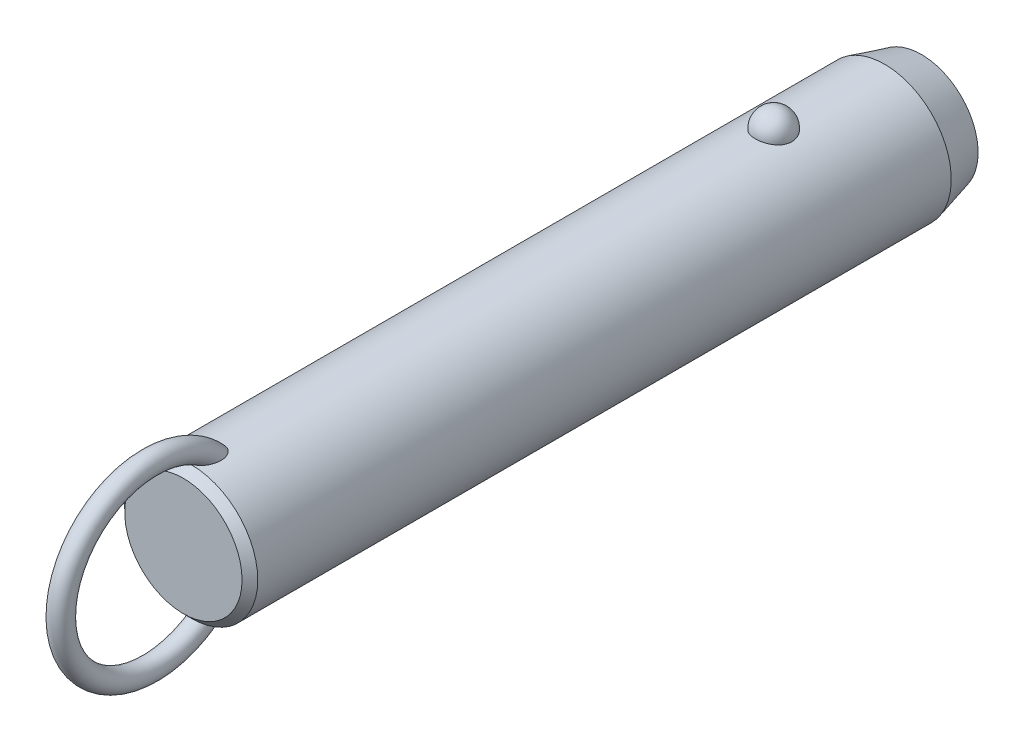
ISO-10303-21;
HEADER;
FILE_DESCRIPTION(('STEP AP214'),'2;1');
FILE_NAME('part.step','',(''),(''),'','','');
FILE_SCHEMA(('AUTOMOTIVE_DESIGN { 1 0 10303 214 1 1 1 1 }'));
ENDSEC;
DATA;
#1=APPLICATION_CONTEXT('core data for automotive mechanical design processes');
#2=APPLICATION_PROTOCOL_DEFINITION('international standard','automotive_design',2000,#1);
#3=PRODUCT_CONTEXT('',#1,'mechanical');
#4=PRODUCT('Part','Part','',(#3));
#5=PRODUCT_RELATED_PRODUCT_CATEGORY('part','',(#4));
#6=PRODUCT_DEFINITION_FORMATION('','',#4);
#7=PRODUCT_DEFINITION_CONTEXT('part definition',#1,'design');
#8=PRODUCT_DEFINITION('design','',#6,#7);
#9=PRODUCT_DEFINITION_SHAPE('','',#8);
#10=(LENGTH_UNIT() NAMED_UNIT(*) SI_UNIT(.MILLI.,.METRE.));
#11=(NAMED_UNIT(*) PLANE_ANGLE_UNIT() SI_UNIT($,.RADIAN.));
#12=(NAMED_UNIT(*) SI_UNIT($,.STERADIAN.) SOLID_ANGLE_UNIT());
#13=UNCERTAINTY_MEASURE_WITH_UNIT(LENGTH_MEASURE(1.E-05),#10,'distance_accuracy_value','');
#14=(GEOMETRIC_REPRESENTATION_CONTEXT(3) GLOBAL_UNCERTAINTY_ASSIGNED_CONTEXT((#13)) GLOBAL_UNIT_ASSIGNED_CONTEXT((#10,
#11,#12)) REPRESENTATION_CONTEXT('',''));
#15=CARTESIAN_POINT('',(0.,0.,0.));
#16=DIRECTION('',(0.,0.,1.));
#17=DIRECTION('',(1.,0.,0.));
#18=AXIS2_PLACEMENT_3D('',#15,#16,#17);
#19=CARTESIAN_POINT('',(0.,0.,96.5));
#20=DIRECTION('',(0.,0.,-1.));
#21=DIRECTION('',(-1.,0.,0.));
#22=AXIS2_PLACEMENT_3D('',#19,#20,#21);
#23=CYLINDRICAL_SURFACE('',#22,12.7);
#24=CARTESIAN_POINT('',(3.46661256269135,12.2177165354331,-3.5));
#25=CARTESIAN_POINT('',(3.4666090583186,12.2177194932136,-3.30432790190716));
#26=CARTESIAN_POINT('',(3.45063567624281,12.2222841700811,-3.10861112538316));
#27=CARTESIAN_POINT('',(3.38712451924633,12.2400345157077,-2.72271899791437));
#28=CARTESIAN_POINT('',(3.33957415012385,12.2532236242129,-2.53254588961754));
#29=CARTESIAN_POINT('',(3.2141234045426,12.286724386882,-2.16324948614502));
#30=CARTESIAN_POINT('',(3.13623639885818,12.3070329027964,-1.98412136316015));
#31=CARTESIAN_POINT('',(2.95205930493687,12.3525018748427,-1.64180592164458));
#32=CARTESIAN_POINT('',(2.84577003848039,12.3776621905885,-1.47861814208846));
#33=CARTESIAN_POINT('',(2.60688050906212,12.4301712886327,-1.17190583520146));
#34=CARTESIAN_POINT('',(2.47415697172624,12.4575299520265,-1.02847897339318));
#35=CARTESIAN_POINT('',(2.18615174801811,12.5112810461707,-0.766177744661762));
#36=CARTESIAN_POINT('',(2.03087002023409,12.5376734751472,-0.64730342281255));
#37=CARTESIAN_POINT('',(1.70237334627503,12.5864761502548,-0.437732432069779));
#38=CARTESIAN_POINT('',(1.52920948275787,12.6088972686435,-0.346958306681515));
#39=CARTESIAN_POINT('',(1.16944170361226,12.6473352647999,-0.195750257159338));
#40=CARTESIAN_POINT('',(0.982839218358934,12.663352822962,-0.135313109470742));
#41=CARTESIAN_POINT('',(0.604961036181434,12.6869706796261,-0.0473241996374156));
#42=CARTESIAN_POINT('',(0.41382314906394,12.6947125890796,-0.0192185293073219));
#43=CARTESIAN_POINT('',(0.0293827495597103,12.7014203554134,0.0051725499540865));
#44=CARTESIAN_POINT('',(-0.163919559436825,12.7003870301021,0.00146092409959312));
#45=CARTESIAN_POINT('',(-0.544374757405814,12.689735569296,-0.0373939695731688));
#46=CARTESIAN_POINT('',(-0.731575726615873,12.6802364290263,-0.0721015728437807));
#47=CARTESIAN_POINT('',(-1.09733277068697,12.6538333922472,-0.171364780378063));
#48=CARTESIAN_POINT('',(-1.27588869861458,12.6369293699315,-0.235920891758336));
#49=CARTESIAN_POINT('',(-1.6204698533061,12.5973946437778,-0.393548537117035));
#50=CARTESIAN_POINT('',(-1.78641865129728,12.5747321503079,-0.486778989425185));
#51=CARTESIAN_POINT('',(-2.10030671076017,12.5261316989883,-0.699110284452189));
#52=CARTESIAN_POINT('',(-2.24824419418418,12.5001934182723,-0.818213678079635));
#53=CARTESIAN_POINT('',(-2.52491489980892,12.4472906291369,-1.08157124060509));
#54=CARTESIAN_POINT('',(-2.65324222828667,12.4203160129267,-1.22624992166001));
#55=CARTESIAN_POINT('',(-2.88410007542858,12.3687509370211,-1.53528325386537));
#56=CARTESIAN_POINT('',(-2.98662883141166,12.3441606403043,-1.69963924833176));
#57=CARTESIAN_POINT('',(-3.16432417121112,12.2998199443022,-2.04548497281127));
#58=CARTESIAN_POINT('',(-3.23917525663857,12.2801261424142,-2.22714424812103));
#59=CARTESIAN_POINT('',(-3.35800573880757,12.248167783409,-2.6009138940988));
#60=CARTESIAN_POINT('',(-3.4019860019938,12.2359030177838,-2.79302397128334));
#61=CARTESIAN_POINT('',(-3.45784812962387,12.2202347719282,-3.18140279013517));
#62=CARTESIAN_POINT('',(-3.46986123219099,12.2167950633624,-3.37765118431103));
#63=CARTESIAN_POINT('',(-3.46186273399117,12.2190638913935,-3.76943689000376));
#64=CARTESIAN_POINT('',(-3.44185196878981,12.2247721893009,-3.96497421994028));
#65=CARTESIAN_POINT('',(-3.37048652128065,12.2446381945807,-4.34881728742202));
#66=CARTESIAN_POINT('',(-3.31928253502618,12.2587552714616,-4.53715319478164));
#67=CARTESIAN_POINT('',(-3.18693461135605,12.2938237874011,-4.90231727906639));
#68=CARTESIAN_POINT('',(-3.1057895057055,12.3147754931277,-5.07914500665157));
#69=CARTESIAN_POINT('',(-2.91506431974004,12.3613125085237,-5.41732059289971));
#70=CARTESIAN_POINT('',(-2.80533587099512,12.3869217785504,-5.57858147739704));
#71=CARTESIAN_POINT('',(-2.560414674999,12.4398525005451,-5.88013283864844));
#72=CARTESIAN_POINT('',(-2.42522099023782,12.4671740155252,-6.02042254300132));
#73=CARTESIAN_POINT('',(-2.1323357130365,12.5205965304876,-6.27662798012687));
#74=CARTESIAN_POINT('',(-1.97456596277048,12.5466928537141,-6.3924554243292));
#75=CARTESIAN_POINT('',(-1.64115839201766,12.5946384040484,-6.59583547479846));
#76=CARTESIAN_POINT('',(-1.46552179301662,12.6164879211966,-6.68339001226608));
#77=CARTESIAN_POINT('',(-1.10356050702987,12.6532533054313,-6.82682153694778));
#78=CARTESIAN_POINT('',(-0.9173913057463,12.6682500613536,-6.8830698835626));
#79=CARTESIAN_POINT('',(-0.537836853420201,12.6900288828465,-6.96386887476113));
#80=CARTESIAN_POINT('',(-0.344452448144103,12.6968119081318,-6.9884232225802));
#81=CARTESIAN_POINT('',(0.0402577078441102,12.7013667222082,-7.00496469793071));
#82=CARTESIAN_POINT('',(0.231556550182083,12.6993008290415,-6.99753844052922));
#83=CARTESIAN_POINT('',(0.610105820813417,12.6867505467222,-6.9516636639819));
#84=CARTESIAN_POINT('',(0.797356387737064,12.6762664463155,-6.913216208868));
#85=CARTESIAN_POINT('',(1.16186657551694,12.6480587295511,-6.80658431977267));
#86=CARTESIAN_POINT('',(1.33915951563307,12.6303611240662,-6.73850666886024));
#87=CARTESIAN_POINT('',(1.67968518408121,12.5896027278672,-6.5745087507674));
#88=CARTESIAN_POINT('',(1.84291705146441,12.5665416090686,-6.47858678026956));
#89=CARTESIAN_POINT('',(2.15340192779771,12.5171072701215,-6.25982455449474));
#90=CARTESIAN_POINT('',(2.30037831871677,12.4906895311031,-6.13660186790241));
#91=CARTESIAN_POINT('',(2.5717412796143,12.4376567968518,-5.86739587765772));
#92=CARTESIAN_POINT('',(2.69612388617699,12.4110417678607,-5.72140858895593));
#93=CARTESIAN_POINT('',(2.92107785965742,12.360051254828,-5.40794137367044));
#94=CARTESIAN_POINT('',(3.02121329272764,12.3357209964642,-5.24014110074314));
#95=CARTESIAN_POINT('',(3.19236291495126,12.2925446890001,-4.88969865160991));
#96=CARTESIAN_POINT('',(3.26338839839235,12.2736965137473,-4.70706226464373));
#97=CARTESIAN_POINT('',(3.36788038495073,12.245404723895,-4.35469510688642));
#98=CARTESIAN_POINT('',(3.40484026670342,12.2351018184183,-4.18605935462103));
#99=CARTESIAN_POINT('',(3.45420764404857,12.2212564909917,-3.84496058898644));
#100=CARTESIAN_POINT('',(3.46661565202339,12.2177139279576,-3.67249765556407));
#101=CARTESIAN_POINT('',(3.46661256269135,12.2177165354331,-3.5));
#102=B_SPLINE_CURVE_WITH_KNOTS('',3,(#24,#25,#26,#27,#28,#29,#30,#31,#32,#33,#34,#35,#36,#37,
#38,#39,#40,#41,#42,#43,#44,#45,#46,#47,#48,#49,#50,#51,#52,#53,#54,#55,#56,#57,#58,#59,#60,#61,
#62,#63,#64,#65,#66,#67,#68,#69,#70,#71,#72,#73,#74,#75,#76,#77,#78,#79,#80,#81,#82,#83,#84,#85,
#86,#87,#88,#89,#90,#91,#92,#93,#94,#95,#96,#97,#98,#99,#100,#101),.UNSPECIFIED.,.T.,.F.,(4,2,2,
2,2,2,2,2,2,2,2,2,2,2,2,2,2,2,2,2,2,2,2,2,2,2,2,2,2,2,2,2,2,2,2,2,2,2,4),(0.,0.586396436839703,
1.17302689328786,1.7593990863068,2.34575431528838,2.93491084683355,3.52406845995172,
4.11158733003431,4.69904375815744,5.2762784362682,5.85345931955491,6.42265312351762,
6.99185659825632,7.56427334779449,8.136746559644,8.71981013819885,9.3029135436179,
9.89247258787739,10.4820150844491,11.0691335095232,11.6562366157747,12.2405256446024,
12.8248374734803,13.412244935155,13.9996740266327,14.5891883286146,15.1786623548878,
15.7609861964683,16.3432419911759,16.9148635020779,17.4864654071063,18.0560241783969,
18.6256177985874,19.2037609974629,19.7820055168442,20.3699810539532,20.957728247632,
21.4746855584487,21.9916320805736),.UNSPECIFIED.);
#103=CARTESIAN_POINT('',(3.46661256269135,12.2177165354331,-3.5));
#104=VERTEX_POINT('',#103);
#105=EDGE_CURVE('E41',#104,#104,#102,.T.);
#106=ORIENTED_EDGE('',*,*,#105,.T.);
#107=EDGE_LOOP('',(#106));
#108=FACE_BOUND('',#107,.T.);
#109=CARTESIAN_POINT('',(0.,0.,107.7));
#110=DIRECTION('',(0.,0.,1.));
#111=DIRECTION('',(1.,0.,0.));
#112=AXIS2_PLACEMENT_3D('',#109,#110,#111);
#113=CIRCLE('',#112,12.7);
#114=CARTESIAN_POINT('',(12.7,0.,107.7));
#115=VERTEX_POINT('',#114);
#116=EDGE_CURVE('E10',#115,#115,#113,.F.);
#117=ORIENTED_EDGE('',*,*,#116,.T.);
#118=EDGE_LOOP('',(#117));
#119=FACE_BOUND('',#118,.T.);
#120=CARTESIAN_POINT('',(-0.548122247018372,-12.6881662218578,101.443218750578));
#121=CARTESIAN_POINT('',(-0.648865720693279,-12.6838128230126,101.477926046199));
#122=CARTESIAN_POINT('',(-0.746398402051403,-12.6783867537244,101.522042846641));
#123=CARTESIAN_POINT('',(-0.93212506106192,-12.666091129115,101.626764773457));
#124=CARTESIAN_POINT('',(-1.02030388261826,-12.6592192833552,101.687396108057));
#125=CARTESIAN_POINT('',(-1.18487740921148,-12.6448747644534,101.821847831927));
#126=CARTESIAN_POINT('',(-1.26134296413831,-12.637406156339,101.895582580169));
#127=CARTESIAN_POINT('',(-1.4023120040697,-12.6225412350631,102.053604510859));
#128=CARTESIAN_POINT('',(-1.46681470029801,-12.6151449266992,102.13789238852));
#129=CARTESIAN_POINT('',(-1.60714786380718,-12.5981718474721,102.349657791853));
#130=CARTESIAN_POINT('',(-1.67725126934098,-12.588900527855,102.480962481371));
#131=CARTESIAN_POINT('',(-1.79536591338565,-12.5725964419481,102.753247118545));
#132=CARTESIAN_POINT('',(-1.84333535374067,-12.5655679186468,102.894244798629));
#133=CARTESIAN_POINT('',(-1.93422576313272,-12.5519624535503,103.237645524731));
#134=CARTESIAN_POINT('',(-1.96788773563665,-12.5466298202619,103.442557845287));
#135=CARTESIAN_POINT('',(-1.9941399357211,-12.542463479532,103.751760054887));
#136=CARTESIAN_POINT('',(-1.99883864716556,-12.5417153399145,103.855298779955));
#137=CARTESIAN_POINT('',(-2.00078003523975,-12.5414074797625,104.06245124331));
#138=CARTESIAN_POINT('',(-1.99802449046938,-12.5418474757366,104.166064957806));
#139=CARTESIAN_POINT('',(-1.98336733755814,-12.5441750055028,104.410320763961));
#140=CARTESIAN_POINT('',(-1.96851430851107,-12.5465291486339,104.550780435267));
#141=CARTESIAN_POINT('',(-1.92707089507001,-12.5529612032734,104.829960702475));
#142=CARTESIAN_POINT('',(-1.90047458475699,-12.5570399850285,104.968680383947));
#143=CARTESIAN_POINT('',(-1.83619120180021,-12.5666008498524,105.24341135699));
#144=CARTESIAN_POINT('',(-1.79850828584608,-12.57208240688,105.379423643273));
#145=CARTESIAN_POINT('',(-1.71223796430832,-12.5841228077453,105.647842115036));
#146=CARTESIAN_POINT('',(-1.66365679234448,-12.5906810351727,105.780250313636));
#147=CARTESIAN_POINT('',(-1.5780450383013,-12.6016176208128,105.98548877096));
#148=CARTESIAN_POINT('',(-1.54477252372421,-12.6057501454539,106.059914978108));
#149=CARTESIAN_POINT('',(-1.47424480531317,-12.6141930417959,106.206839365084));
#150=CARTESIAN_POINT('',(-1.43699041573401,-12.6185033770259,106.279337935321));
#151=CARTESIAN_POINT('',(-1.35825795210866,-12.6272207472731,106.421892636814));
#152=CARTESIAN_POINT('',(-1.31678520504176,-12.6316276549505,106.491951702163));
#153=CARTESIAN_POINT('',(-1.22917793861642,-12.6404532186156,106.629070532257));
#154=CARTESIAN_POINT('',(-1.18304514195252,-12.6448718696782,106.696131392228));
#155=CARTESIAN_POINT('',(-1.07246411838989,-12.6547893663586,106.843874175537));
#156=CARTESIAN_POINT('',(-1.00642239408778,-12.6602600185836,106.923384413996));
#157=CARTESIAN_POINT('',(-0.864441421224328,-12.6707460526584,107.073169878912));
#158=CARTESIAN_POINT('',(-0.78851691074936,-12.6757620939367,107.143458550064));
#159=CARTESIAN_POINT('',(-0.652215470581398,-12.6833591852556,107.248680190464));
#160=CARTESIAN_POINT('',(-0.594982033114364,-12.6861973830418,107.287624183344));
#161=CARTESIAN_POINT('',(-0.475269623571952,-12.6912445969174,107.356489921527));
#162=CARTESIAN_POINT('',(-0.412800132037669,-12.6934547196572,107.386427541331));
#163=CARTESIAN_POINT('',(-0.295749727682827,-12.6966636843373,107.429756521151));
#164=CARTESIAN_POINT('',(-0.241949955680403,-12.6978134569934,107.445218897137));
#165=CARTESIAN_POINT('',(-0.132508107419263,-12.6994261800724,107.466884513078));
#166=CARTESIAN_POINT('',(-0.0768679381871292,-12.6998898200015,107.473097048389));
#167=CARTESIAN_POINT('',(0.0347696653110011,-12.7000752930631,107.475583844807));
#168=CARTESIAN_POINT('',(0.0907676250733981,-12.6997954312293,107.471835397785));
#169=CARTESIAN_POINT('',(0.201283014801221,-12.6985255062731,107.454788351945));
#170=CARTESIAN_POINT('',(0.255799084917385,-12.6975348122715,107.441481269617));
#171=CARTESIAN_POINT('',(0.376042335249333,-12.6946091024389,107.40203792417));
#172=CARTESIAN_POINT('',(0.44095085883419,-12.6924943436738,107.373449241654));
#173=CARTESIAN_POINT('',(0.565350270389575,-12.6875639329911,107.306323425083));
#174=CARTESIAN_POINT('',(0.624828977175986,-12.6847467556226,107.267764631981));
#175=CARTESIAN_POINT('',(0.774116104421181,-12.6767252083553,107.156949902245));
#176=CARTESIAN_POINT('',(0.859449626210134,-12.6711344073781,107.078760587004));
#177=CARTESIAN_POINT('',(1.01789440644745,-12.6593922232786,106.910943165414));
#178=CARTESIAN_POINT('',(1.09096902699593,-12.653239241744,106.821282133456));
#179=CARTESIAN_POINT('',(1.22268793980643,-12.6411674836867,106.640265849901));
#180=CARTESIAN_POINT('',(1.28193986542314,-12.6352572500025,106.549345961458));
#181=CARTESIAN_POINT('',(1.39259777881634,-12.6235401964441,106.362792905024));
#182=CARTESIAN_POINT('',(1.44399707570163,-12.6177334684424,106.267155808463));
#183=CARTESIAN_POINT('',(1.53972870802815,-12.6064093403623,106.072273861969));
#184=CARTESIAN_POINT('',(1.58405262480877,-12.6008922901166,105.973024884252));
#185=CARTESIAN_POINT('',(1.66600705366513,-12.5903187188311,105.771772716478));
#186=CARTESIAN_POINT('',(1.70363651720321,-12.5852622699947,105.669769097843));
#187=CARTESIAN_POINT('',(1.77545379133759,-12.5753406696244,105.454358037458));
#188=CARTESIAN_POINT('',(1.80903453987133,-12.5705328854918,105.340745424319));
#189=CARTESIAN_POINT('',(1.86844163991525,-12.5618400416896,105.111457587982));
#190=CARTESIAN_POINT('',(1.89426665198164,-12.5579551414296,104.995782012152));
#191=CARTESIAN_POINT('',(1.9378546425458,-12.5513030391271,104.763007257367));
#192=CARTESIAN_POINT('',(1.9556264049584,-12.5485346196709,104.645909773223));
#193=CARTESIAN_POINT('',(1.98264463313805,-12.5442934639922,104.410747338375));
#194=CARTESIAN_POINT('',(1.99189298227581,-12.5428204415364,104.29268260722));
#195=CARTESIAN_POINT('',(2.00416068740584,-12.540871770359,103.980622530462));
#196=CARTESIAN_POINT('',(1.99944433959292,-12.541631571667,103.786229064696));
#197=CARTESIAN_POINT('',(1.96113755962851,-12.5476846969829,103.400309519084));
#198=CARTESIAN_POINT('',(1.92758341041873,-12.5529723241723,103.208780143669));
#199=CARTESIAN_POINT('',(1.83934342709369,-12.5661532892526,102.882272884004));
#200=CARTESIAN_POINT('',(1.79215440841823,-12.5730485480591,102.74524997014));
#201=CARTESIAN_POINT('',(1.67676242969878,-12.588958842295,102.480445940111));
#202=CARTESIAN_POINT('',(1.60859050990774,-12.597970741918,102.352651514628));
#203=CARTESIAN_POINT('',(1.46583832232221,-12.6152829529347,102.135800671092));
#204=CARTESIAN_POINT('',(1.39525727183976,-12.6233659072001,102.04410500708));
#205=CARTESIAN_POINT('',(1.23992594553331,-12.6395676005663,101.873485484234));
#206=CARTESIAN_POINT('',(1.1551793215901,-12.6476863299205,101.794558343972));
#207=CARTESIAN_POINT('',(0.971995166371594,-12.6630846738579,101.652643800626));
#208=CARTESIAN_POINT('',(0.873456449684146,-12.6703572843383,101.589784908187));
#209=CARTESIAN_POINT('',(0.665847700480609,-12.6829569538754,101.484487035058));
#210=CARTESIAN_POINT('',(0.556784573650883,-12.688285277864,101.442034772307));
#211=CARTESIAN_POINT('',(0.347338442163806,-12.6956226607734,101.384443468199));
#212=CARTESIAN_POINT('',(0.247759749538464,-12.6979816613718,101.366399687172));
#213=CARTESIAN_POINT('',(0.0470218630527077,-12.7003077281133,101.348600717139));
#214=CARTESIAN_POINT('',(-0.0541350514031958,-12.7002779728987,101.348821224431));
#215=CARTESIAN_POINT('',(-0.221414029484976,-12.6982482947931,101.364363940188));
#216=CARTESIAN_POINT('',(-0.288055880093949,-12.6969033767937,101.374666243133));
#217=CARTESIAN_POINT('',(-0.419599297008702,-12.6932369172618,101.40313489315));
#218=CARTESIAN_POINT('',(-0.484501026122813,-12.6909154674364,101.421300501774));
#219=CARTESIAN_POINT('',(-0.548122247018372,-12.6881662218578,101.443218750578));
#220=B_SPLINE_CURVE_WITH_KNOTS('',3,(#120,#121,#122,#123,#124,#125,#126,#127,#128,#129,#130,
#131,#132,#133,#134,#135,#136,#137,#138,#139,#140,#141,#142,#143,#144,#145,#146,#147,#148,#149,
#150,#151,#152,#153,#154,#155,#156,#157,#158,#159,#160,#161,#162,#163,#164,#165,#166,#167,#168,
#169,#170,#171,#172,#173,#174,#175,#176,#177,#178,#179,#180,#181,#182,#183,#184,#185,#186,#187,
#188,#189,#190,#191,#192,#193,#194,#195,#196,#197,#198,#199,#200,#201,#202,#203,#204,#205,#206,
#207,#208,#209,#210,#211,#212,#213,#214,#215,#216,#217,#218,#219),.UNSPECIFIED.,.T.,.F.,(4,2,2,
2,2,2,2,2,2,2,2,2,2,2,2,2,2,2,2,2,2,2,2,2,2,2,2,2,2,2,2,2,2,2,2,2,2,2,2,2,2,2,2,2,2,2,2,2,2,4),
(0.,0.31964225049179,0.639794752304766,0.957927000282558,1.27608021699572,1.72100165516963,
2.16675988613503,2.78630021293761,3.0970578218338,3.40774128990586,3.83096358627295,
4.2543996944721,4.67767724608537,5.10071330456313,5.34550297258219,5.59024267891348,
5.83467707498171,6.07902143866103,6.38891080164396,6.69834321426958,6.90560910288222,
7.11250749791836,7.27977315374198,7.44687060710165,7.61434932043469,7.78197685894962,
7.99365544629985,8.20579780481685,8.55147335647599,8.89816429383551,9.22375138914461,
9.5496143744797,9.87586224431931,10.202161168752,10.557587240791,10.9130746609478,
11.2681734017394,11.6231936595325,12.2046601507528,12.7853961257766,13.219164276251,
13.6522938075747,13.9989174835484,14.3454519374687,14.6946768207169,15.0436740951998,
15.3457513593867,15.6474266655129,15.8493051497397,16.0511646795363),.UNSPECIFIED.);
#221=CARTESIAN_POINT('',(-0.548122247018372,-12.6881662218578,101.443218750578));
#222=VERTEX_POINT('',#221);
#223=EDGE_CURVE('E59',#222,#222,#220,.T.);
#224=ORIENTED_EDGE('',*,*,#223,.T.);
#225=EDGE_LOOP('',(#224));
#226=FACE_BOUND('',#225,.T.);
#227=CARTESIAN_POINT('',(-0.548122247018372,12.6881662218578,101.443218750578));
#228=CARTESIAN_POINT('',(-0.459436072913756,12.6919968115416,101.412673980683));
#229=CARTESIAN_POINT('',(-0.368189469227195,12.6949996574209,101.389391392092));
#230=CARTESIAN_POINT('',(-0.183024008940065,12.6990186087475,101.358406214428));
#231=CARTESIAN_POINT('',(-0.0891049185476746,12.7000345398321,101.350704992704));
#232=CARTESIAN_POINT('',(0.0987147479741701,12.6999636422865,101.351245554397));
#233=CARTESIAN_POINT('',(0.192615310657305,12.6988761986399,101.359492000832));
#234=CARTESIAN_POINT('',(0.377658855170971,12.6947211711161,101.391551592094));
#235=CARTESIAN_POINT('',(0.468801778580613,12.6916535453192,101.415365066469));
#236=CARTESIAN_POINT('',(0.645809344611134,12.6838788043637,101.47745651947));
#237=CARTESIAN_POINT('',(0.731679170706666,12.6791733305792,101.515720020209));
#238=CARTESIAN_POINT('',(0.896315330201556,12.6686004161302,101.605120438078));
#239=CARTESIAN_POINT('',(0.975080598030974,12.6627328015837,101.656259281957));
#240=CARTESIAN_POINT('',(1.12963655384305,12.6499161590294,101.77367820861));
#241=CARTESIAN_POINT('',(1.20478673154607,12.6429194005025,101.840792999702));
#242=CARTESIAN_POINT('',(1.34448241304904,12.6288282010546,101.98522507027));
#243=CARTESIAN_POINT('',(1.40902173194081,12.621733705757,102.062548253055));
#244=CARTESIAN_POINT('',(1.55208211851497,12.6050877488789,102.259247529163));
#245=CARTESIAN_POINT('',(1.62510490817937,12.5957546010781,102.382654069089));
#246=CARTESIAN_POINT('',(1.7501904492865,12.5789823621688,102.639769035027));
#247=CARTESIAN_POINT('',(1.80221377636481,12.5715468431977,102.773496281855));
#248=CARTESIAN_POINT('',(1.90309965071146,12.5567434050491,103.098351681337));
#249=CARTESIAN_POINT('',(1.94342317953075,12.5504515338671,103.292161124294));
#250=CARTESIAN_POINT('',(1.99332997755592,12.5426147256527,103.68378810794));
#251=CARTESIAN_POINT('',(2.00285305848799,12.5410790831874,103.881612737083));
#252=CARTESIAN_POINT('',(1.99678999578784,12.5420407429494,104.216642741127));
#253=CARTESIAN_POINT('',(1.98794117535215,12.5434564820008,104.354042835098));
#254=CARTESIAN_POINT('',(1.95865119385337,12.5480641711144,104.627639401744));
#255=CARTESIAN_POINT('',(1.93820436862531,12.5512569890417,104.763835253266));
#256=CARTESIAN_POINT('',(1.88647896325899,12.5591352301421,105.034249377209));
#257=CARTESIAN_POINT('',(1.85518800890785,12.5638223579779,105.16846520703));
#258=CARTESIAN_POINT('',(1.78217886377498,12.5743868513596,105.433936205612));
#259=CARTESIAN_POINT('',(1.74046509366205,12.5802637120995,105.565192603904));
#260=CARTESIAN_POINT('',(1.66024095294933,12.5910571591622,105.786085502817));
#261=CARTESIAN_POINT('',(1.62434772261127,12.5957535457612,105.876690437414));
#262=CARTESIAN_POINT('',(1.5470900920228,12.6054762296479,106.055512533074));
#263=CARTESIAN_POINT('',(1.50572681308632,12.6105024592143,106.143730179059));
#264=CARTESIAN_POINT('',(1.41728020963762,12.620748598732,106.316932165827));
#265=CARTESIAN_POINT('',(1.37021377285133,12.625967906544,106.401925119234));
#266=CARTESIAN_POINT('',(1.26969620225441,12.6364721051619,106.568007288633));
#267=CARTESIAN_POINT('',(1.21624929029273,12.6417569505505,106.649099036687));
#268=CARTESIAN_POINT('',(1.10304413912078,12.6521331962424,106.804702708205));
#269=CARTESIAN_POINT('',(1.04340936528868,12.657226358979,106.879303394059));
#270=CARTESIAN_POINT('',(0.91591933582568,12.6670906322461,107.021324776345));
#271=CARTESIAN_POINT('',(0.84806456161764,12.6718617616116,107.08874589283));
#272=CARTESIAN_POINT('',(0.717035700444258,12.67987711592,107.200624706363));
#273=CARTESIAN_POINT('',(0.655526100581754,12.6832377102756,107.246997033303));
#274=CARTESIAN_POINT('',(0.525985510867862,12.6892676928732,107.329619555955));
#275=CARTESIAN_POINT('',(0.45796984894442,12.6919386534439,107.365892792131));
#276=CARTESIAN_POINT('',(0.334859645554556,12.695691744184,107.416657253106));
#277=CARTESIAN_POINT('',(0.281116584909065,12.6970073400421,107.434373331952));
#278=CARTESIAN_POINT('',(0.171425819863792,12.6989609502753,107.460642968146));
#279=CARTESIAN_POINT('',(0.11548082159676,12.699599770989,107.469207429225));
#280=CARTESIAN_POINT('',(0.00272618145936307,12.7001251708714,107.476253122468));
#281=CARTESIAN_POINT('',(-0.0540859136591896,12.7000089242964,107.474696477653));
#282=CARTESIAN_POINT('',(-0.166544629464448,12.6990328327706,107.461600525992));
#283=CARTESIAN_POINT('',(-0.222190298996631,12.6981724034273,107.450053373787));
#284=CARTESIAN_POINT('',(-0.342018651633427,12.695562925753,107.414912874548));
#285=CARTESIAN_POINT('',(-0.405606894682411,12.6936676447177,107.38933225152));
#286=CARTESIAN_POINT('',(-0.527815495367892,12.6891754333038,107.328311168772));
#287=CARTESIAN_POINT('',(-0.586425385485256,12.6865770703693,107.292850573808));
#288=CARTESIAN_POINT('',(-0.731842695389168,12.6792129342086,107.191496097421));
#289=CARTESIAN_POINT('',(-0.814709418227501,12.6740767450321,107.1200395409));
#290=CARTESIAN_POINT('',(-0.969101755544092,12.6632083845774,106.96589007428));
#291=CARTESIAN_POINT('',(-1.04059564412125,12.6574746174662,106.883166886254));
#292=CARTESIAN_POINT('',(-1.1698111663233,12.6461638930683,106.715809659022));
#293=CARTESIAN_POINT('',(-1.22811369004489,12.6405994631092,106.631616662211));
#294=CARTESIAN_POINT('',(-1.33743405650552,12.6295007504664,106.458579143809));
#295=CARTESIAN_POINT('',(-1.38844577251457,12.6239664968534,106.369730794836));
#296=CARTESIAN_POINT('',(-1.48400702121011,12.6130898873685,106.188389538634));
#297=CARTESIAN_POINT('',(-1.52854232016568,12.6077479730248,106.095889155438));
#298=CARTESIAN_POINT('',(-1.6115011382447,12.5974127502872,105.908160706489));
#299=CARTESIAN_POINT('',(-1.64992317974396,12.5924195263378,105.812931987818));
#300=CARTESIAN_POINT('',(-1.73468589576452,12.581070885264,105.58289362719));
#301=CARTESIAN_POINT('',(-1.77831261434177,12.5749388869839,105.447066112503));
#302=CARTESIAN_POINT('',(-1.85439734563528,12.5639437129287,105.172212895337));
#303=CARTESIAN_POINT('',(-1.88684994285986,12.5590811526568,105.033185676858));
#304=CARTESIAN_POINT('',(-1.94008483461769,12.550968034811,104.75309235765));
#305=CARTESIAN_POINT('',(-1.96088706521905,12.5477147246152,104.612030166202));
#306=CARTESIAN_POINT('',(-1.99000539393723,12.5431291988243,104.328668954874));
#307=CARTESIAN_POINT('',(-1.99832911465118,12.5417958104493,104.186370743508));
#308=CARTESIAN_POINT('',(-2.00166624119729,12.5412674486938,103.857627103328));
#309=CARTESIAN_POINT('',(-1.99178843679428,12.5428579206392,103.671088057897));
#310=CARTESIAN_POINT('',(-1.9445518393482,12.5502731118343,103.30162404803));
#311=CARTESIAN_POINT('',(-1.90724032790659,12.5560905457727,103.118693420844));
#312=CARTESIAN_POINT('',(-1.81330718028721,12.5699462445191,102.804848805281));
#313=CARTESIAN_POINT('',(-1.76338820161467,12.5771273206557,102.671910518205));
#314=CARTESIAN_POINT('',(-1.64305018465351,12.593414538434,102.415681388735));
#315=CARTESIAN_POINT('',(-1.57265346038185,12.6025185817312,102.292380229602));
#316=CARTESIAN_POINT('',(-1.42634956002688,12.6198178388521,102.083564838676));
#317=CARTESIAN_POINT('',(-1.35423772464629,12.6278405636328,101.995384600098));
#318=CARTESIAN_POINT('',(-1.19645664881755,12.6437632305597,101.832107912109));
#319=CARTESIAN_POINT('',(-1.11080536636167,12.6516633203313,101.756994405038));
#320=CARTESIAN_POINT('',(-0.947219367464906,12.6648319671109,101.637811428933));
#321=CARTESIAN_POINT('',(-0.871624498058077,12.670300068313,101.590541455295));
#322=CARTESIAN_POINT('',(-0.714161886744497,12.6801492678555,101.5077413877));
#323=CARTESIAN_POINT('',(-0.632295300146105,12.684530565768,101.47220913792));
#324=CARTESIAN_POINT('',(-0.548122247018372,12.6881662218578,101.443218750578));
#325=B_SPLINE_CURVE_WITH_KNOTS('',3,(#227,#228,#229,#230,#231,#232,#233,#234,#235,#236,#237,
#238,#239,#240,#241,#242,#243,#244,#245,#246,#247,#248,#249,#250,#251,#252,#253,#254,#255,#256,
#257,#258,#259,#260,#261,#262,#263,#264,#265,#266,#267,#268,#269,#270,#271,#272,#273,#274,#275,
#276,#277,#278,#279,#280,#281,#282,#283,#284,#285,#286,#287,#288,#289,#290,#291,#292,#293,#294,
#295,#296,#297,#298,#299,#300,#301,#302,#303,#304,#305,#306,#307,#308,#309,#310,#311,#312,#313,
#314,#315,#316,#317,#318,#319,#320,#321,#322,#323,#324),.UNSPECIFIED.,.T.,.F.,(4,2,2,2,2,2,2,2,
2,2,2,2,2,2,2,2,2,2,2,2,2,2,2,2,2,2,2,2,2,2,2,2,2,2,2,2,2,2,2,2,2,2,2,2,2,2,2,2,4),(0.,
0.281328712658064,0.562682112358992,0.844117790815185,1.12555942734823,1.40671982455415,
1.68792232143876,1.98972294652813,2.29169886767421,2.72039860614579,3.14989948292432,
3.74084916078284,4.33295293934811,4.74554109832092,5.15833092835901,5.57159335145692,
5.98468079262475,6.2772277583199,6.5697148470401,6.86135609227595,7.15280542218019,
7.43927407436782,7.72572595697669,7.95635862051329,8.18646071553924,8.35559393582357,
8.52452541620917,8.69408946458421,8.86378678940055,9.06834348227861,9.27332014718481,
9.60010414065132,9.92778432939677,10.2350252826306,10.5425229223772,10.8506864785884,
11.1589244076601,11.5867893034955,12.0148612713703,12.4421984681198,12.8692745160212,
13.4279365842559,13.9856380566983,14.4107062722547,14.8353130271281,15.1765567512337,
15.5173516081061,15.7844129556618,16.051425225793),.UNSPECIFIED.);
#326=CARTESIAN_POINT('',(-0.548122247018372,12.6881662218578,101.443218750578));
#327=VERTEX_POINT('',#326);
#328=EDGE_CURVE('E67',#327,#327,#325,.T.);
#329=ORIENTED_EDGE('',*,*,#328,.T.);
#330=EDGE_LOOP('',(#329));
#331=FACE_BOUND('',#330,.T.);
#332=CARTESIAN_POINT('',(0.,0.,-24.6999999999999));
#333=DIRECTION('',(0.,0.,-1.));
#334=DIRECTION('',(-1.,0.,0.));
#335=AXIS2_PLACEMENT_3D('',#332,#333,#334);
#336=CIRCLE('',#335,12.7);
#337=CARTESIAN_POINT('',(-12.7,0.,-24.6999999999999));
#338=VERTEX_POINT('',#337);
#339=EDGE_CURVE('E56',#338,#338,#336,.F.);
#340=ORIENTED_EDGE('',*,*,#339,.T.);
#341=EDGE_LOOP('',(#340));
#342=FACE_BOUND('',#341,.T.);
#343=ADVANCED_FACE('F37',(#108,#119,#226,#331,#342),#23,.T.);
#344=CARTESIAN_POINT('',(0.,0.,-31.7));
#345=DIRECTION('',(0.,0.,-1.));
#346=DIRECTION('',(-1.,0.,0.));
#347=AXIS2_PLACEMENT_3D('',#344,#345,#346);
#348=PLANE('',#347);
#349=CARTESIAN_POINT('',(0.,0.,-31.7));
#350=DIRECTION('',(0.,0.,-1.));
#351=DIRECTION('',(-1.,0.,0.));
#352=AXIS2_PLACEMENT_3D('',#349,#350,#351);
#353=CIRCLE('',#352,10.8243556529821);
#354=CARTESIAN_POINT('',(-10.8243556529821,0.,-31.7));
#355=VERTEX_POINT('',#354);
#356=EDGE_CURVE('E66',#355,#355,#353,.T.);
#357=ORIENTED_EDGE('',*,*,#356,.T.);
#358=EDGE_LOOP('',(#357));
#359=FACE_BOUND('',#358,.T.);
#360=ADVANCED_FACE('F85',(#359),#348,.T.);
#361=CARTESIAN_POINT('',(0.,0.,-31.7));
#362=DIRECTION('',(0.,0.,1.));
#363=DIRECTION('',(1.,0.,0.));
#364=AXIS2_PLACEMENT_3D('',#361,#362,#363);
#365=CONICAL_SURFACE('',#364,10.8243556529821,0.261799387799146);
#366=ORIENTED_EDGE('',*,*,#339,.F.);
#367=EDGE_LOOP('',(#366));
#368=FACE_BOUND('',#367,.T.);
#369=ORIENTED_EDGE('',*,*,#356,.F.);
#370=EDGE_LOOP('',(#369));
#371=FACE_BOUND('',#370,.T.);
#372=ADVANCED_FACE('F83',(#368,#371),#365,.T.);
#373=CARTESIAN_POINT('',(0.,0.,109.2));
#374=DIRECTION('',(0.,0.,1.));
#375=DIRECTION('',(1.,0.,0.));
#376=AXIS2_PLACEMENT_3D('',#373,#374,#375);
#377=PLANE('',#376);
#378=CARTESIAN_POINT('',(0.,0.,109.2));
#379=DIRECTION('',(0.,0.,1.));
#380=DIRECTION('',(1.,0.,0.));
#381=AXIS2_PLACEMENT_3D('',#378,#379,#380);
#382=CIRCLE('',#381,11.2);
#383=CARTESIAN_POINT('',(11.2,0.,109.2));
#384=VERTEX_POINT('',#383);
#385=EDGE_CURVE('E50',#384,#384,#382,.T.);
#386=ORIENTED_EDGE('',*,*,#385,.T.);
#387=EDGE_LOOP('',(#386));
#388=FACE_BOUND('',#387,.T.);
#389=ADVANCED_FACE('F77',(#388),#377,.T.);
#390=CARTESIAN_POINT('',(0.,0.,115.55));
#391=DIRECTION('',(1.,0.,0.));
#392=DIRECTION('',(0.,0.,-1.));
#393=AXIS2_PLACEMENT_3D('',#390,#391,#392);
#394=TOROIDAL_SURFACE('',#393,17.05,2.);
#395=ORIENTED_EDGE('',*,*,#328,.F.);
#396=EDGE_LOOP('',(#395));
#397=FACE_BOUND('',#396,.T.);
#398=ORIENTED_EDGE('',*,*,#223,.F.);
#399=EDGE_LOOP('',(#398));
#400=FACE_BOUND('',#399,.T.);
#401=ADVANCED_FACE('F73',(#397,#400),#394,.T.);
#402=CARTESIAN_POINT('',(0.,0.,109.2));
#403=DIRECTION('',(0.,0.,-1.));
#404=DIRECTION('',(-1.,0.,0.));
#405=AXIS2_PLACEMENT_3D('',#402,#403,#404);
#406=CONICAL_SURFACE('',#405,11.2,0.785398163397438);
#407=ORIENTED_EDGE('',*,*,#116,.F.);
#408=EDGE_LOOP('',(#407));
#409=FACE_BOUND('',#408,.T.);
#410=ORIENTED_EDGE('',*,*,#385,.F.);
#411=EDGE_LOOP('',(#410));
#412=FACE_BOUND('',#411,.T.);
#413=ADVANCED_FACE('F39',(#409,#412),#406,.T.);
#414=CARTESIAN_POINT('',(0.,12.7,-3.5));
#415=DIRECTION('',(0.,1.,0.));
#416=DIRECTION('',(0.,0.,-1.));
#417=AXIS2_PLACEMENT_3D('',#414,#415,#416);
#418=SPHERICAL_SURFACE('',#417,3.5);
#419=ORIENTED_EDGE('',*,*,#105,.F.);
#420=EDGE_LOOP('',(#419));
#421=FACE_BOUND('',#420,.T.);
#422=ADVANCED_FACE('F79',(#421),#418,.T.);
#423=CLOSED_SHELL('',(#343,#360,#372,#389,#401,#413,#422));
#424=MANIFOLD_SOLID_BREP('B2',#423);
#425=ADVANCED_BREP_SHAPE_REPRESENTATION('',(#18,#424),#14);
#426=SHAPE_DEFINITION_REPRESENTATION(#9,#425);
ENDSEC;
END-ISO-10303-21;
